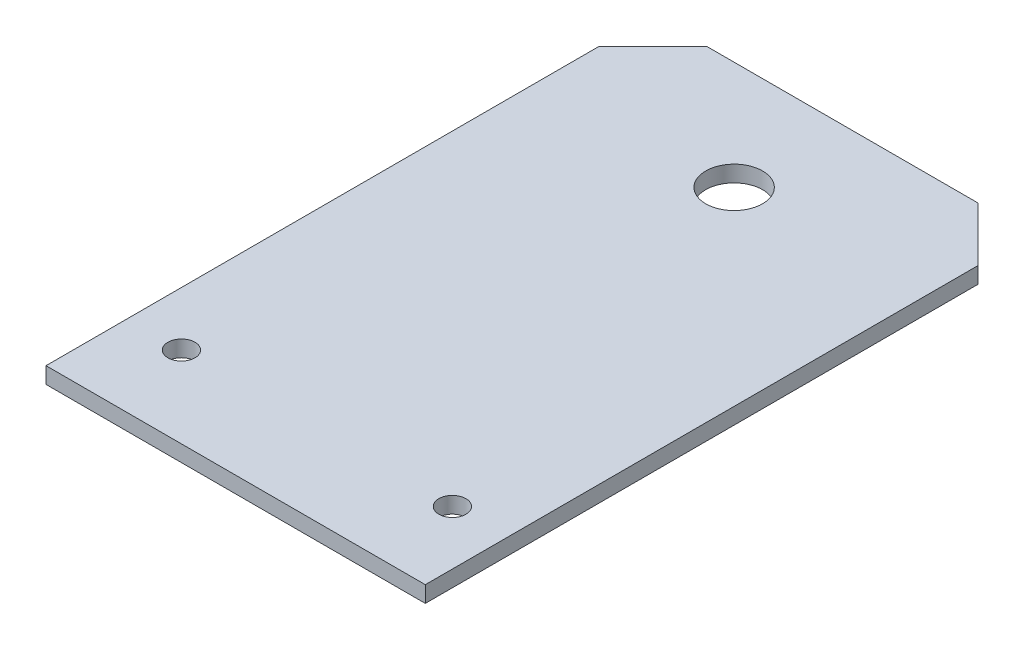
from build123d import *

# Parameters (mm, degrees)
SKETCH1_R      = 5.25
SKETCH1_R_2    = 2.5
EXTRUDE1_DEPTH = 3


with BuildPart() as part:
    # Sketch1 → Extrude1 (new body)
    with BuildSketch(Plane(origin=(0, 0, 0), x_dir=(1, 0, 0), z_dir=(0, 1, 0))):
        Polygon((0, 0), (70, 0), (70, 102), (60, 112), (10, 112), (0, 102), align=None)
        with Locations(Location((35, 92, 0), (0, 0, 270))):
            Circle(SKETCH1_R, mode=Mode.SUBTRACT)
        with Locations(Location((10, 15, 0), (0, 0, 270))):
            Circle(SKETCH1_R_2, mode=Mode.SUBTRACT)
        with Locations(Location((60, 15, 0), (0, 0, 270))):
            Circle(SKETCH1_R_2, mode=Mode.SUBTRACT)
    extrude(amount=EXTRUDE1_DEPTH)


solid = part.part
